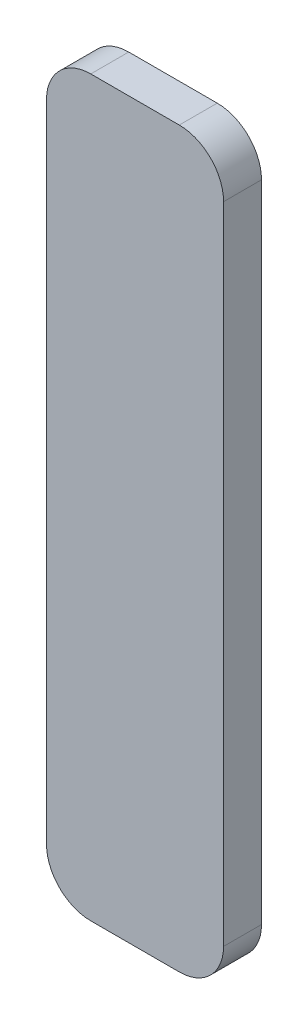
ISO-10303-21;
HEADER;
FILE_DESCRIPTION(('STEP AP214'),'2;1');
FILE_NAME('part.step','',(''),(''),'','','');
FILE_SCHEMA(('AUTOMOTIVE_DESIGN { 1 0 10303 214 1 1 1 1 }'));
ENDSEC;
DATA;
#1=APPLICATION_CONTEXT('core data for automotive mechanical design processes');
#2=APPLICATION_PROTOCOL_DEFINITION('international standard','automotive_design',2000,#1);
#3=PRODUCT_CONTEXT('',#1,'mechanical');
#4=PRODUCT('Part','Part','',(#3));
#5=PRODUCT_RELATED_PRODUCT_CATEGORY('part','',(#4));
#6=PRODUCT_DEFINITION_FORMATION('','',#4);
#7=PRODUCT_DEFINITION_CONTEXT('part definition',#1,'design');
#8=PRODUCT_DEFINITION('design','',#6,#7);
#9=PRODUCT_DEFINITION_SHAPE('','',#8);
#10=(LENGTH_UNIT() NAMED_UNIT(*) SI_UNIT(.MILLI.,.METRE.));
#11=(NAMED_UNIT(*) PLANE_ANGLE_UNIT() SI_UNIT($,.RADIAN.));
#12=(NAMED_UNIT(*) SI_UNIT($,.STERADIAN.) SOLID_ANGLE_UNIT());
#13=UNCERTAINTY_MEASURE_WITH_UNIT(LENGTH_MEASURE(1.E-05),#10,'distance_accuracy_value','');
#14=(GEOMETRIC_REPRESENTATION_CONTEXT(3) GLOBAL_UNCERTAINTY_ASSIGNED_CONTEXT((#13)) GLOBAL_UNIT_ASSIGNED_CONTEXT((#10,
#11,#12)) REPRESENTATION_CONTEXT('',''));
#15=CARTESIAN_POINT('',(0.,0.,0.));
#16=DIRECTION('',(0.,0.,1.));
#17=DIRECTION('',(1.,0.,0.));
#18=AXIS2_PLACEMENT_3D('',#15,#16,#17);
#19=CARTESIAN_POINT('',(-0.1778,-0.7366,0.));
#20=DIRECTION('',(0.,0.,1.));
#21=DIRECTION('',(1.,0.,0.));
#22=AXIS2_PLACEMENT_3D('',#19,#20,#21);
#23=PLANE('',#22);
#24=CARTESIAN_POINT('',(0.0889,-0.6477,0.));
#25=DIRECTION('',(0.,0.,1.));
#26=DIRECTION('',(1.,0.,0.));
#27=AXIS2_PLACEMENT_3D('',#24,#25,#26);
#28=CIRCLE('',#27,0.0888999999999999);
#29=CARTESIAN_POINT('',(0.08889975,-0.7366,0.));
#30=VERTEX_POINT('',#29);
#31=CARTESIAN_POINT('',(0.1778,-0.64769975,0.));
#32=VERTEX_POINT('',#31);
#33=EDGE_CURVE('E149',#30,#32,#28,.T.);
#34=ORIENTED_EDGE('',*,*,#33,.F.);
#35=CARTESIAN_POINT('',(-0.0889,-0.7366,0.));
#36=CARTESIAN_POINT('',(0.0889,-0.7366,0.));
#37=B_SPLINE_CURVE_WITH_KNOTS('',1,(#35,#36),.UNSPECIFIED.,.F.,.F.,(2,2),(0.,1.),.UNSPECIFIED.);
#38=CARTESIAN_POINT('',(-0.08889975,-0.7366,0.));
#39=VERTEX_POINT('',#38);
#40=EDGE_CURVE('E107',#39,#30,#37,.T.);
#41=ORIENTED_EDGE('',*,*,#40,.F.);
#42=CARTESIAN_POINT('',(-0.0889,-0.6477,0.));
#43=DIRECTION('',(0.,0.,1.));
#44=DIRECTION('',(1.,0.,0.));
#45=AXIS2_PLACEMENT_3D('',#42,#43,#44);
#46=CIRCLE('',#45,0.0889);
#47=CARTESIAN_POINT('',(-0.1778,-0.64769975,0.));
#48=VERTEX_POINT('',#47);
#49=EDGE_CURVE('E151',#48,#39,#46,.T.);
#50=ORIENTED_EDGE('',*,*,#49,.F.);
#51=CARTESIAN_POINT('',(-0.1778,0.6477,0.));
#52=CARTESIAN_POINT('',(-0.1778,-0.6477,0.));
#53=B_SPLINE_CURVE_WITH_KNOTS('',1,(#51,#52),.UNSPECIFIED.,.F.,.F.,(2,2),(0.,1.),.UNSPECIFIED.);
#54=CARTESIAN_POINT('',(-0.1778,0.64769975,0.));
#55=VERTEX_POINT('',#54);
#56=EDGE_CURVE('E117',#55,#48,#53,.T.);
#57=ORIENTED_EDGE('',*,*,#56,.F.);
#58=CARTESIAN_POINT('',(-0.0889,0.6477,0.));
#59=DIRECTION('',(0.,0.,1.));
#60=DIRECTION('',(1.,0.,0.));
#61=AXIS2_PLACEMENT_3D('',#58,#59,#60);
#62=CIRCLE('',#61,0.0888999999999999);
#63=CARTESIAN_POINT('',(-0.08889975,0.7366,0.));
#64=VERTEX_POINT('',#63);
#65=EDGE_CURVE('E153',#64,#55,#62,.T.);
#66=ORIENTED_EDGE('',*,*,#65,.F.);
#67=CARTESIAN_POINT('',(0.0889,0.7366,0.));
#68=CARTESIAN_POINT('',(-0.0889,0.7366,0.));
#69=B_SPLINE_CURVE_WITH_KNOTS('',1,(#67,#68),.UNSPECIFIED.,.F.,.F.,(2,2),(0.,1.),.UNSPECIFIED.);
#70=CARTESIAN_POINT('',(0.08889975,0.7366,0.));
#71=VERTEX_POINT('',#70);
#72=EDGE_CURVE('E85',#71,#64,#69,.T.);
#73=ORIENTED_EDGE('',*,*,#72,.F.);
#74=CARTESIAN_POINT('',(0.0889,0.6477,0.));
#75=DIRECTION('',(0.,0.,1.));
#76=DIRECTION('',(1.,0.,0.));
#77=AXIS2_PLACEMENT_3D('',#74,#75,#76);
#78=CIRCLE('',#77,0.0889);
#79=CARTESIAN_POINT('',(0.1778,0.6477,2.49999999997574E-07));
#80=VERTEX_POINT('',#79);
#81=EDGE_CURVE('E21',#80,#71,#78,.T.);
#82=ORIENTED_EDGE('',*,*,#81,.F.);
#83=CARTESIAN_POINT('',(0.1778,-0.6477,0.));
#84=CARTESIAN_POINT('',(0.1778,0.6477,0.));
#85=B_SPLINE_CURVE_WITH_KNOTS('',1,(#83,#84),.UNSPECIFIED.,.F.,.F.,(2,2),(0.,1.),.UNSPECIFIED.);
#86=EDGE_CURVE('E83',#32,#80,#85,.T.);
#87=ORIENTED_EDGE('',*,*,#86,.F.);
#88=EDGE_LOOP('',(#34,#41,#50,#57,#66,#73,#82,#87));
#89=FACE_BOUND('',#88,.T.);
#90=ADVANCED_FACE('F17',(#89),#23,.F.);
#91=CARTESIAN_POINT('',(0.1778,0.6477,0.0762));
#92=CARTESIAN_POINT('',(0.1778,0.6477,0.));
#93=B_SPLINE_CURVE_WITH_KNOTS('',1,(#91,#92),.UNSPECIFIED.,.F.,.F.,(2,2),(0.,1.),.UNSPECIFIED.);
#94=CARTESIAN_POINT('',(0.0889,0.6477,0.));
#95=DIRECTION('',(0.,0.,1.));
#96=AXIS1_PLACEMENT('',#94,#95);
#97=SURFACE_OF_REVOLUTION('',#93,#96);
#98=CARTESIAN_POINT('',(0.1778,0.6477,0.0762));
#99=CARTESIAN_POINT('',(0.1778,0.6477,0.));
#100=B_SPLINE_CURVE_WITH_KNOTS('',1,(#98,#99),.UNSPECIFIED.,.F.,.F.,(2,2),(0.,1.),.UNSPECIFIED.);
#101=CARTESIAN_POINT('',(0.1778,0.6477,0.0762));
#102=VERTEX_POINT('',#101);
#103=EDGE_CURVE('E89',#80,#102,#100,.F.);
#104=ORIENTED_EDGE('',*,*,#103,.F.);
#105=ORIENTED_EDGE('',*,*,#81,.T.);
#106=CARTESIAN_POINT('',(0.0889,0.7366,0.0762));
#107=CARTESIAN_POINT('',(0.0889,0.7366,0.));
#108=B_SPLINE_CURVE_WITH_KNOTS('',1,(#106,#107),.UNSPECIFIED.,.F.,.F.,(2,2),(0.,1.),.UNSPECIFIED.);
#109=CARTESIAN_POINT('',(0.0889,0.7366,0.0762));
#110=VERTEX_POINT('',#109);
#111=EDGE_CURVE('E133',#110,#71,#108,.T.);
#112=ORIENTED_EDGE('',*,*,#111,.F.);
#113=CARTESIAN_POINT('',(0.0889,0.6477,0.0762));
#114=DIRECTION('',(0.,0.,1.));
#115=DIRECTION('',(1.,0.,0.));
#116=AXIS2_PLACEMENT_3D('',#113,#114,#115);
#117=CIRCLE('',#116,0.0889);
#118=EDGE_CURVE('E92',#102,#110,#117,.T.);
#119=ORIENTED_EDGE('',*,*,#118,.F.);
#120=EDGE_LOOP('',(#104,#105,#112,#119));
#121=FACE_BOUND('',#120,.T.);
#122=ADVANCED_FACE('F90',(#121),#97,.F.);
#123=CARTESIAN_POINT('',(0.0889,0.7366,0.0762));
#124=DIRECTION('',(0.,1.,0.));
#125=DIRECTION('',(0.,0.,-1.));
#126=AXIS2_PLACEMENT_3D('',#123,#124,#125);
#127=PLANE('',#126);
#128=ORIENTED_EDGE('',*,*,#111,.T.);
#129=ORIENTED_EDGE('',*,*,#72,.T.);
#130=CARTESIAN_POINT('',(-0.0889,0.7366,0.0762));
#131=CARTESIAN_POINT('',(-0.0889,0.7366,0.));
#132=B_SPLINE_CURVE_WITH_KNOTS('',1,(#130,#131),.UNSPECIFIED.,.F.,.F.,(2,2),(0.,1.),.UNSPECIFIED.);
#133=CARTESIAN_POINT('',(-0.0889,0.7366,0.0762));
#134=VERTEX_POINT('',#133);
#135=EDGE_CURVE('E126',#134,#64,#132,.T.);
#136=ORIENTED_EDGE('',*,*,#135,.F.);
#137=DIRECTION('',(-1.,0.,0.));
#138=VECTOR('',#137,1.);
#139=CARTESIAN_POINT('',(0.,0.7366,0.0762));
#140=LINE('',#139,#138);
#141=EDGE_CURVE('E147',#110,#134,#140,.T.);
#142=ORIENTED_EDGE('',*,*,#141,.F.);
#143=EDGE_LOOP('',(#128,#129,#136,#142));
#144=FACE_BOUND('',#143,.T.);
#145=ADVANCED_FACE('F188',(#144),#127,.T.);
#146=CARTESIAN_POINT('',(-0.0889,0.7366,0.0762));
#147=CARTESIAN_POINT('',(-0.0889,0.7366,0.));
#148=B_SPLINE_CURVE_WITH_KNOTS('',1,(#146,#147),.UNSPECIFIED.,.F.,.F.,(2,2),(0.,1.),.UNSPECIFIED.);
#149=CARTESIAN_POINT('',(-0.0889,0.6477,0.));
#150=DIRECTION('',(0.,0.,1.));
#151=AXIS1_PLACEMENT('',#149,#150);
#152=SURFACE_OF_REVOLUTION('',#148,#151);
#153=ORIENTED_EDGE('',*,*,#135,.T.);
#154=ORIENTED_EDGE('',*,*,#65,.T.);
#155=CARTESIAN_POINT('',(-0.1778,0.6477,0.0762));
#156=CARTESIAN_POINT('',(-0.1778,0.6477,0.));
#157=B_SPLINE_CURVE_WITH_KNOTS('',1,(#155,#156),.UNSPECIFIED.,.F.,.F.,(2,2),(0.,1.),.UNSPECIFIED.);
#158=CARTESIAN_POINT('',(-0.1778,0.6477,0.0762));
#159=VERTEX_POINT('',#158);
#160=EDGE_CURVE('E125',#159,#55,#157,.T.);
#161=ORIENTED_EDGE('',*,*,#160,.F.);
#162=CARTESIAN_POINT('',(-0.0889,0.6477,0.0762));
#163=DIRECTION('',(0.,0.,1.));
#164=DIRECTION('',(1.,0.,0.));
#165=AXIS2_PLACEMENT_3D('',#162,#163,#164);
#166=CIRCLE('',#165,0.0888999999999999);
#167=EDGE_CURVE('E144',#134,#159,#166,.T.);
#168=ORIENTED_EDGE('',*,*,#167,.F.);
#169=EDGE_LOOP('',(#153,#154,#161,#168));
#170=FACE_BOUND('',#169,.T.);
#171=ADVANCED_FACE('F183',(#170),#152,.F.);
#172=CARTESIAN_POINT('',(-0.1778,0.6477,0.0762));
#173=DIRECTION('',(-1.,0.,0.));
#174=DIRECTION('',(0.,0.,-1.));
#175=AXIS2_PLACEMENT_3D('',#172,#173,#174);
#176=PLANE('',#175);
#177=ORIENTED_EDGE('',*,*,#160,.T.);
#178=ORIENTED_EDGE('',*,*,#56,.T.);
#179=CARTESIAN_POINT('',(-0.1778,-0.6477,0.0762));
#180=CARTESIAN_POINT('',(-0.1778,-0.6477,0.));
#181=B_SPLINE_CURVE_WITH_KNOTS('',1,(#179,#180),.UNSPECIFIED.,.F.,.F.,(2,2),(0.,1.),.UNSPECIFIED.);
#182=CARTESIAN_POINT('',(-0.1778,-0.6477,0.0762));
#183=VERTEX_POINT('',#182);
#184=EDGE_CURVE('E116',#183,#48,#181,.T.);
#185=ORIENTED_EDGE('',*,*,#184,.F.);
#186=DIRECTION('',(0.,-1.,0.));
#187=VECTOR('',#186,1.);
#188=CARTESIAN_POINT('',(-0.1778,0.,0.0762));
#189=LINE('',#188,#187);
#190=EDGE_CURVE('E143',#159,#183,#189,.T.);
#191=ORIENTED_EDGE('',*,*,#190,.F.);
#192=EDGE_LOOP('',(#177,#178,#185,#191));
#193=FACE_BOUND('',#192,.T.);
#194=ADVANCED_FACE('F187',(#193),#176,.T.);
#195=CARTESIAN_POINT('',(-0.1778,-0.6477,0.0762));
#196=CARTESIAN_POINT('',(-0.1778,-0.6477,0.));
#197=B_SPLINE_CURVE_WITH_KNOTS('',1,(#195,#196),.UNSPECIFIED.,.F.,.F.,(2,2),(0.,1.),.UNSPECIFIED.);
#198=CARTESIAN_POINT('',(-0.0889,-0.6477,0.));
#199=DIRECTION('',(0.,0.,1.));
#200=AXIS1_PLACEMENT('',#198,#199);
#201=SURFACE_OF_REVOLUTION('',#197,#200);
#202=ORIENTED_EDGE('',*,*,#184,.T.);
#203=ORIENTED_EDGE('',*,*,#49,.T.);
#204=CARTESIAN_POINT('',(-0.0889,-0.7366,0.0762));
#205=CARTESIAN_POINT('',(-0.0889,-0.7366,0.));
#206=B_SPLINE_CURVE_WITH_KNOTS('',1,(#204,#205),.UNSPECIFIED.,.F.,.F.,(2,2),(0.,1.),.UNSPECIFIED.);
#207=CARTESIAN_POINT('',(-0.0889,-0.7366,0.0762));
#208=VERTEX_POINT('',#207);
#209=EDGE_CURVE('E115',#208,#39,#206,.T.);
#210=ORIENTED_EDGE('',*,*,#209,.F.);
#211=CARTESIAN_POINT('',(-0.0889,-0.6477,0.0762));
#212=DIRECTION('',(0.,0.,1.));
#213=DIRECTION('',(1.,0.,0.));
#214=AXIS2_PLACEMENT_3D('',#211,#212,#213);
#215=CIRCLE('',#214,0.0889);
#216=EDGE_CURVE('E140',#183,#208,#215,.T.);
#217=ORIENTED_EDGE('',*,*,#216,.F.);
#218=EDGE_LOOP('',(#202,#203,#210,#217));
#219=FACE_BOUND('',#218,.T.);
#220=ADVANCED_FACE('F189',(#219),#201,.F.);
#221=CARTESIAN_POINT('',(-0.0889,-0.7366,0.0762));
#222=DIRECTION('',(0.,-1.,0.));
#223=DIRECTION('',(0.,0.,-1.));
#224=AXIS2_PLACEMENT_3D('',#221,#222,#223);
#225=PLANE('',#224);
#226=ORIENTED_EDGE('',*,*,#209,.T.);
#227=ORIENTED_EDGE('',*,*,#40,.T.);
#228=CARTESIAN_POINT('',(0.0889,-0.7366,0.0762));
#229=CARTESIAN_POINT('',(0.0889,-0.7366,0.));
#230=B_SPLINE_CURVE_WITH_KNOTS('',1,(#228,#229),.UNSPECIFIED.,.F.,.F.,(2,2),(0.,1.),.UNSPECIFIED.);
#231=CARTESIAN_POINT('',(0.0889,-0.7366,0.0762));
#232=VERTEX_POINT('',#231);
#233=EDGE_CURVE('E94',#232,#30,#230,.T.);
#234=ORIENTED_EDGE('',*,*,#233,.F.);
#235=DIRECTION('',(1.,0.,0.));
#236=VECTOR('',#235,1.);
#237=CARTESIAN_POINT('',(0.,-0.7366,0.0762));
#238=LINE('',#237,#236);
#239=EDGE_CURVE('E139',#208,#232,#238,.T.);
#240=ORIENTED_EDGE('',*,*,#239,.F.);
#241=EDGE_LOOP('',(#226,#227,#234,#240));
#242=FACE_BOUND('',#241,.T.);
#243=ADVANCED_FACE('F201',(#242),#225,.T.);
#244=CARTESIAN_POINT('',(0.0889,-0.7366,0.0762));
#245=CARTESIAN_POINT('',(0.0889,-0.7366,0.));
#246=B_SPLINE_CURVE_WITH_KNOTS('',1,(#244,#245),.UNSPECIFIED.,.F.,.F.,(2,2),(0.,1.),.UNSPECIFIED.);
#247=CARTESIAN_POINT('',(0.0889,-0.6477,0.));
#248=DIRECTION('',(0.,0.,1.));
#249=AXIS1_PLACEMENT('',#247,#248);
#250=SURFACE_OF_REVOLUTION('',#246,#249);
#251=ORIENTED_EDGE('',*,*,#233,.T.);
#252=ORIENTED_EDGE('',*,*,#33,.T.);
#253=CARTESIAN_POINT('',(0.1778,-0.6477,0.0762));
#254=CARTESIAN_POINT('',(0.1778,-0.6477,0.));
#255=B_SPLINE_CURVE_WITH_KNOTS('',1,(#253,#254),.UNSPECIFIED.,.F.,.F.,(2,2),(0.,1.),.UNSPECIFIED.);
#256=CARTESIAN_POINT('',(0.1778,-0.6477,0.0762));
#257=VERTEX_POINT('',#256);
#258=EDGE_CURVE('E36',#257,#32,#255,.T.);
#259=ORIENTED_EDGE('',*,*,#258,.F.);
#260=CARTESIAN_POINT('',(0.0889,-0.6477,0.0762));
#261=DIRECTION('',(0.,0.,1.));
#262=DIRECTION('',(1.,0.,0.));
#263=AXIS2_PLACEMENT_3D('',#260,#261,#262);
#264=CIRCLE('',#263,0.0888999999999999);
#265=EDGE_CURVE('E27',#232,#257,#264,.T.);
#266=ORIENTED_EDGE('',*,*,#265,.F.);
#267=EDGE_LOOP('',(#251,#252,#259,#266));
#268=FACE_BOUND('',#267,.T.);
#269=ADVANCED_FACE('F203',(#268),#250,.F.);
#270=CARTESIAN_POINT('',(0.1778,-0.6477,0.0762));
#271=DIRECTION('',(1.,0.,0.));
#272=DIRECTION('',(0.,0.,-1.));
#273=AXIS2_PLACEMENT_3D('',#270,#271,#272);
#274=PLANE('',#273);
#275=ORIENTED_EDGE('',*,*,#258,.T.);
#276=ORIENTED_EDGE('',*,*,#86,.T.);
#277=ORIENTED_EDGE('',*,*,#103,.T.);
#278=DIRECTION('',(0.,1.,0.));
#279=VECTOR('',#278,1.);
#280=CARTESIAN_POINT('',(0.1778,0.,0.0762));
#281=LINE('',#280,#279);
#282=EDGE_CURVE('E11',#257,#102,#281,.T.);
#283=ORIENTED_EDGE('',*,*,#282,.F.);
#284=EDGE_LOOP('',(#275,#276,#277,#283));
#285=FACE_BOUND('',#284,.T.);
#286=ADVANCED_FACE('F96',(#285),#274,.T.);
#287=CARTESIAN_POINT('',(-0.1778,-0.7366,0.0762));
#288=DIRECTION('',(0.,0.,1.));
#289=DIRECTION('',(1.,0.,0.));
#290=AXIS2_PLACEMENT_3D('',#287,#288,#289);
#291=PLANE('',#290);
#292=ORIENTED_EDGE('',*,*,#265,.T.);
#293=ORIENTED_EDGE('',*,*,#282,.T.);
#294=ORIENTED_EDGE('',*,*,#118,.T.);
#295=ORIENTED_EDGE('',*,*,#141,.T.);
#296=ORIENTED_EDGE('',*,*,#167,.T.);
#297=ORIENTED_EDGE('',*,*,#190,.T.);
#298=ORIENTED_EDGE('',*,*,#216,.T.);
#299=ORIENTED_EDGE('',*,*,#239,.T.);
#300=EDGE_LOOP('',(#292,#293,#294,#295,#296,#297,#298,#299));
#301=FACE_BOUND('',#300,.T.);
#302=ADVANCED_FACE('F19',(#301),#291,.T.);
#303=CLOSED_SHELL('',(#90,#122,#145,#171,#194,#220,#243,#269,#286,#302));
#304=MANIFOLD_SOLID_BREP('B1',#303);
#305=ADVANCED_BREP_SHAPE_REPRESENTATION('',(#18,#304),#14);
#306=SHAPE_DEFINITION_REPRESENTATION(#9,#305);
ENDSEC;
END-ISO-10303-21;
